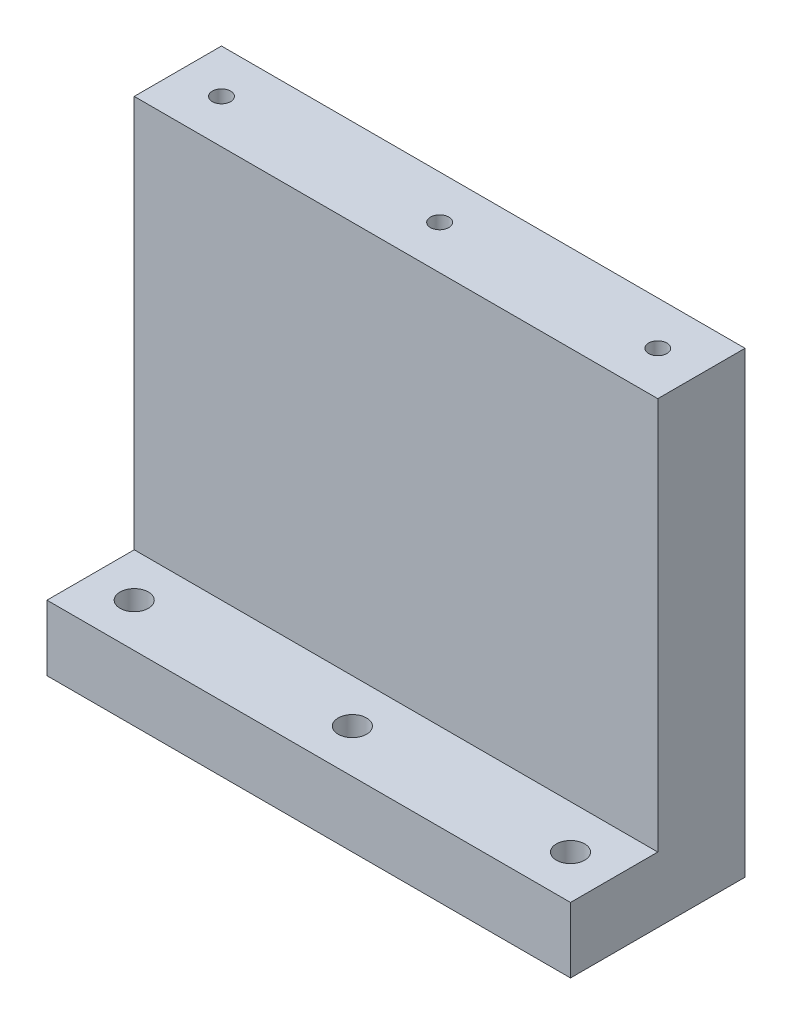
from build123d import *

# Parameters (mm, degrees)
SKETCH_1_W          = 120
SKETCH_1_H          = 105
EXTRUDE_1_DEPTH     = 40
SKETCH_2_OUTSIDE_W  = 74.878
SKETCH_2_OUTSIDE_H  = 139.878
CUT_EXTRUDE_1_DEPTH = 165.392822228
SKETCH_3_R          = 3.25
CUT_EXTRUDE_2_DEPTH = 40
SKETCH_4_R          = 2.1
CUT_EXTRUDE_3_DEPTH = 15


with BuildPart() as part:
    # Sketch 1 → Extrude 1 (new body)
    with BuildSketch(Plane.XY):
        with Locations((60, 52.5)):
            Rectangle(SKETCH_1_W, SKETCH_1_H)
    extrude(amount=EXTRUDE_1_DEPTH)

    # Sketch 2 outside → Cut-Extrude 1 (cut, through all)
    with BuildSketch(Plane(origin=(120, 0, 0), x_dir=(0, 0, -1), z_dir=(1, 0, 0))):
        with Locations((-20, 52.5)):
            Rectangle(SKETCH_2_OUTSIDE_W, SKETCH_2_OUTSIDE_H)
        Polygon((-20, 15), (-20, 105), (0, 105), (0, 0), (-40, 0), (-40, 15), align=None, mode=Mode.SUBTRACT)
    extrude(amount=-CUT_EXTRUDE_1_DEPTH, mode=Mode.SUBTRACT)

    # Sketch 3 → Cut-Extrude 2 (cut)
    with BuildSketch(Plane(origin=(0, 15, 0), x_dir=(1, 0, 0), z_dir=(0, 1, 0))):
        with Locations(Location((110, -30, 0), (0, 0, 270))):
            Circle(SKETCH_3_R)
        with Locations(Location((60, -30, 0), (0, 0, 270))):
            Circle(SKETCH_3_R)
        with Locations(Location((10, -30, 0), (0, 0, 270))):
            Circle(SKETCH_3_R)
    extrude(amount=-CUT_EXTRUDE_2_DEPTH, mode=Mode.SUBTRACT)

    # Sketch 4 → Cut-Extrude 3 (cut)
    with BuildSketch(Plane(origin=(0, 105, 0), x_dir=(1, 0, 0), z_dir=(0, 1, 0))):
        with Locations(Location((10, -10, 0), (0, 0, 270))):
            Circle(SKETCH_4_R)
        with Locations(Location((60, -10, 0), (0, 0, 270))):
            Circle(SKETCH_4_R)
        with Locations(Location((110, -10, 0), (0, 0, 270))):
            Circle(SKETCH_4_R)
    extrude(amount=-CUT_EXTRUDE_3_DEPTH, mode=Mode.SUBTRACT)


solid = part.part
